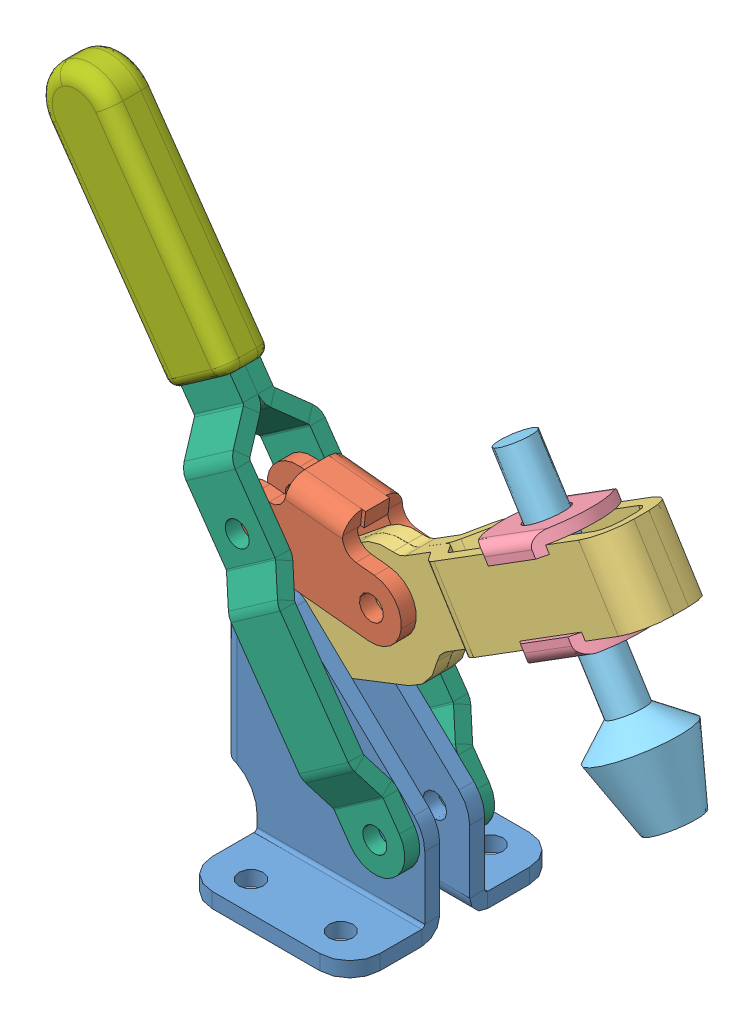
SolidWorks assembly collision.sldasm, configuration Default (file format 8000). Lengths in mm.
Overall size (151.57 125.24 44.45).
11 component instances, 7 part files, 10 mates.
Components (placement in the parent):
- base-2: base.SLDPRT [Default] at origin size (42.93 49.25 44.45)
- link-2: link.SLDPRT [Default] at (6.3491 58.7362 0) x (0.99488 -0.101064 0) z (0 0 1) size (38.1 19.05 12.7)
- hold-down sub-assy-1: hold-down sub-assy.SLDASM [Default] at (9.5597 31.1019 -6.35) x (0.847327 0.531072 0) z (0 0 1) size (96.01 63.5 19.3)
  - arm-1: arm.SLDPRT [Default] at origin size (96.01 23.62 15.88)
  - washer-1: washer.SLDPRT [Default] at (73.787 -2.286 0) x (0 0 -1) z (1 0 0) size (18.8 3.81 22.23)
  - washer-2: washer.SLDPRT [Default] at (73.787 18.161 0) x (0 0 -1) z (-1 0 0) size (18.8 3.81 22.23)
  - hold-down bolt-1: hold-down bolt.sldprt [Default] at (73.787 -32.766 0) size (19.3 63.5 19.3)
- handle sub-assy-1: handle sub-assy.sldasm [Default] at (13.8492 -2.9413 -12.7) x (0.574188 -0.818723 0) z (0 0 1) size (132.59 16.51 25.4)
  - handle-half-1: handle-half.SLDPRT [Default] at (2.3468 22.924 12.7) size (130.68 12.7 12.7)
  - handle-half-2: handle-half.SLDPRT [Default] at (2.3468 35.624 0) x (1 0 0) z (0 0 -1) size (130.68 12.7 12.7)
  - sleeve-1: sleeve.sldprt [Default] at (-128.3362 22.924 3.175) size (52.77 16.51 10.16)
Mates (geometry in assembly coordinates):
- MateCoincident15: coincident aligned: plane of base-2 through (0 50.8 0) normal (0 0 1); plane of assembly through (0 0 0) normal (0 0 1)
- MateCoincident16: coincident anti-aligned: plane of base-2 through (0 0 -12.7) normal (0 -1 0); plane of assembly through (0 0 0) normal (0 1 0)
- MateCoincident17: coincident anti-aligned: plane of base-2 through (0 50.8 -12.7) normal (-1 0 0); plane of assembly through (0 0 0) normal (1 0 0)
- MateConcentric10: concentric aligned: cylinder of base-2 through (35.5179 17.145 -28.575) axis (0 0 1) radius 2.54; cylinder of handle sub-assy-1/handle-half-1 through (35.5179 17.145 -6.35) axis (0 0 1) radius 2.54
- MateCoincident20: coincident anti-aligned: plane of base-2 through (0 50.8 0) normal (0 0 1); plane of handle sub-assy-1/handle-half-1 through (44.3629 15.5922 0) normal (0 0 -1)
- MateConcentric11: concentric aligned: cylinder of handle sub-assy-1/handle-half-1 through (6.3491 58.7362 -6.35) axis (0 0 1) radius 2.54; cylinder of link-2 through (6.3491 58.7362 -12.7) axis (0 0 1) radius 2.54
- MateCoincident21: coincident anti-aligned: plane of handle sub-assy-1/handle-half-1 through (14.9024 57.5993 0) normal (0 0 -1); plane of link-2 through (-0.6101 53.0604 0) normal (0 0 1)
- Concentric1: concentric aligned: cylinder of base-2 through (9.8818 42.545 -28.575) axis (0 0 1) radius 2.54; cylinder of hold-down sub-assy-1/arm-1 through (9.8818 42.545 -14.2875) axis (0 0 1) radius 2.54
- Coincident1: coincident anti-aligned: plane of base-2 through (42.926 50.8 -3.175) normal (0 0 -1); plane of hold-down sub-assy-1/arm-1 through (7.765 29.9771 -3.175) normal (0 0 1)
- Concentric2: concentric aligned: cylinder of hold-down sub-assy-1/arm-1 through (31.6191 56.1691 -14.2875) axis (0 0 1) radius 2.54; cylinder of link-2 through (31.6191 56.1691 -12.7) axis (0 0 1) radius 2.54
